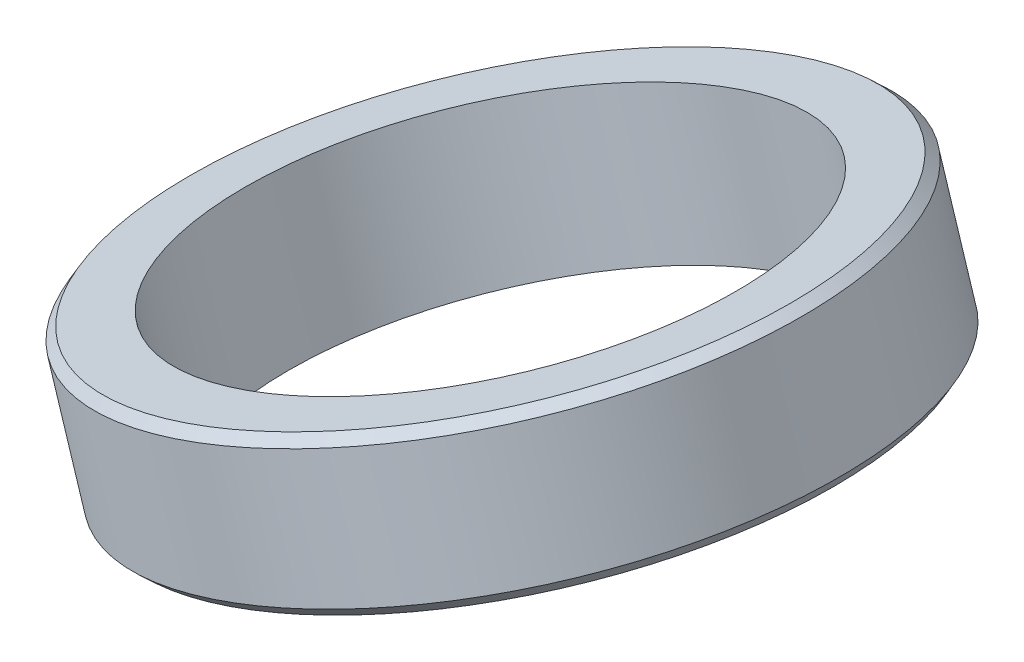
from build123d import *


with BuildPart() as part:
    # Sk_Contratuerca → Contratuerca (revolve)
    with BuildSketch(Plane.XY, mode=Mode.PRIVATE) as contratuerca_sk:
        Polygon((370.413114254, 564.580213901), (373.464999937, 565.542499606), (374.092214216, 565.215999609), (376.197214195, 558.539999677), (375.870714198, 557.912785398), (372.818828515, 556.950499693), align=None)
    revolve(contratuerca_sk.sketch.rotate(Axis((355.271428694, 565.048571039, 0), (0.3007142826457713, -0.9537142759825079, 0)), 180), axis=Axis((355.271428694, 565.048571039, 0), (0.3007142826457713, -0.9537142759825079, 0)))


solid = part.part
